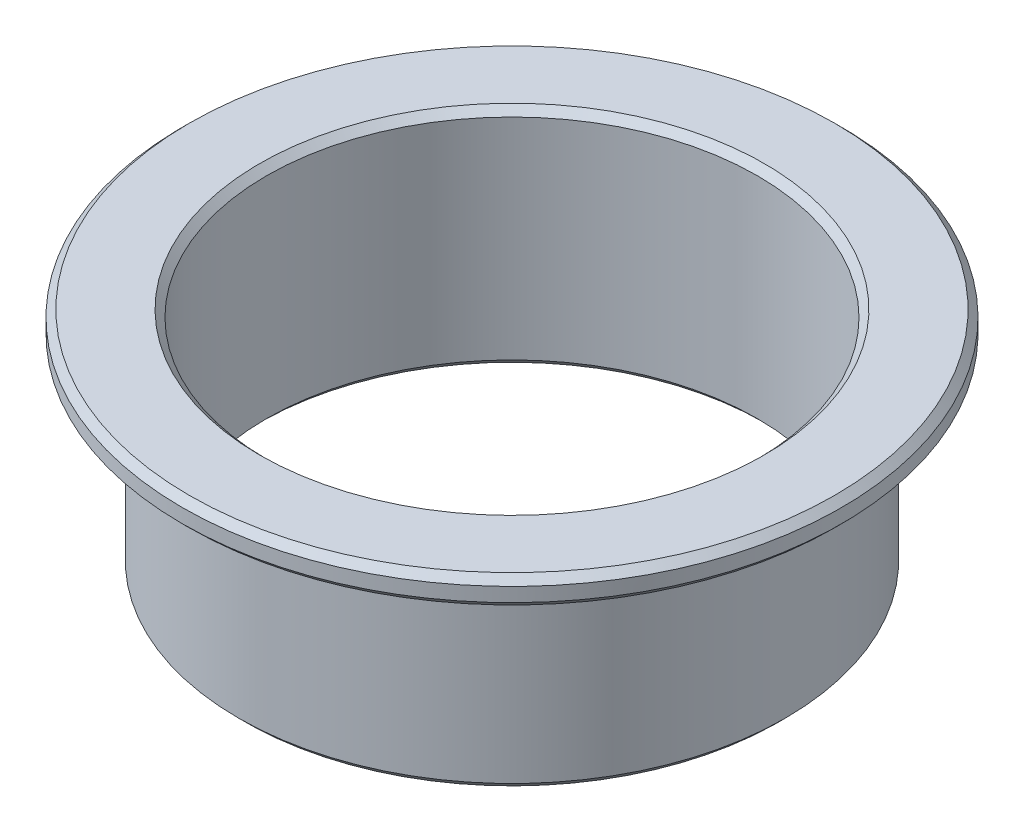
ISO-10303-21;
HEADER;
FILE_DESCRIPTION(('STEP AP214'),'2;1');
FILE_NAME('part.step','',(''),(''),'','','');
FILE_SCHEMA(('AUTOMOTIVE_DESIGN { 1 0 10303 214 1 1 1 1 }'));
ENDSEC;
DATA;
#1=APPLICATION_CONTEXT('core data for automotive mechanical design processes');
#2=APPLICATION_PROTOCOL_DEFINITION('international standard','automotive_design',2000,#1);
#3=PRODUCT_CONTEXT('',#1,'mechanical');
#4=PRODUCT('Part','Part','',(#3));
#5=PRODUCT_RELATED_PRODUCT_CATEGORY('part','',(#4));
#6=PRODUCT_DEFINITION_FORMATION('','',#4);
#7=PRODUCT_DEFINITION_CONTEXT('part definition',#1,'design');
#8=PRODUCT_DEFINITION('design','',#6,#7);
#9=PRODUCT_DEFINITION_SHAPE('','',#8);
#10=(LENGTH_UNIT() NAMED_UNIT(*) SI_UNIT(.MILLI.,.METRE.));
#11=(NAMED_UNIT(*) PLANE_ANGLE_UNIT() SI_UNIT($,.RADIAN.));
#12=(NAMED_UNIT(*) SI_UNIT($,.STERADIAN.) SOLID_ANGLE_UNIT());
#13=UNCERTAINTY_MEASURE_WITH_UNIT(LENGTH_MEASURE(1.E-05),#10,'distance_accuracy_value','');
#14=(GEOMETRIC_REPRESENTATION_CONTEXT(3) GLOBAL_UNCERTAINTY_ASSIGNED_CONTEXT((#13)) GLOBAL_UNIT_ASSIGNED_CONTEXT((#10,
#11,#12)) REPRESENTATION_CONTEXT('',''));
#15=CARTESIAN_POINT('',(0.,0.,0.));
#16=DIRECTION('',(0.,0.,1.));
#17=DIRECTION('',(1.,0.,0.));
#18=AXIS2_PLACEMENT_3D('',#15,#16,#17);
#19=CARTESIAN_POINT('',(0.,32.8284930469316,0.));
#20=DIRECTION('',(0.,1.,0.));
#21=DIRECTION('',(0.,0.,1.));
#22=AXIS2_PLACEMENT_3D('',#19,#20,#21);
#23=CYLINDRICAL_SURFACE('',#22,17.5);
#24=CARTESIAN_POINT('',(0.,-7.25131404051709,0.));
#25=DIRECTION('',(0.,-1.,0.));
#26=DIRECTION('',(0.,0.,-1.));
#27=AXIS2_PLACEMENT_3D('',#24,#25,#26);
#28=CIRCLE('',#27,17.5);
#29=CARTESIAN_POINT('',(0.,-7.25131404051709,-17.5));
#30=VERTEX_POINT('',#29);
#31=EDGE_CURVE('E39',#30,#30,#28,.T.);
#32=ORIENTED_EDGE('',*,*,#31,.T.);
#33=EDGE_LOOP('',(#32));
#34=FACE_BOUND('',#33,.T.);
#35=CARTESIAN_POINT('',(0.,7.7486859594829,0.));
#36=DIRECTION('',(0.,1.,0.));
#37=DIRECTION('',(0.,0.,1.));
#38=AXIS2_PLACEMENT_3D('',#35,#36,#37);
#39=CIRCLE('',#38,17.5);
#40=CARTESIAN_POINT('',(0.,7.7486859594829,17.5));
#41=VERTEX_POINT('',#40);
#42=EDGE_CURVE('E43',#41,#41,#39,.T.);
#43=ORIENTED_EDGE('',*,*,#42,.T.);
#44=EDGE_LOOP('',(#43));
#45=FACE_BOUND('',#44,.T.);
#46=ADVANCED_FACE('F32',(#34,#45),#23,.F.);
#47=CARTESIAN_POINT('',(-17.5,8.24868595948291,0.));
#48=DIRECTION('',(0.,1.,0.));
#49=DIRECTION('',(0.,0.,1.));
#50=AXIS2_PLACEMENT_3D('',#47,#48,#49);
#51=PLANE('',#50);
#52=CARTESIAN_POINT('',(0.,8.24868595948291,0.));
#53=DIRECTION('',(0.,1.,0.));
#54=DIRECTION('',(0.,0.,1.));
#55=AXIS2_PLACEMENT_3D('',#52,#53,#54);
#56=CIRCLE('',#55,23.);
#57=CARTESIAN_POINT('',(0.,8.24868595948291,23.));
#58=VERTEX_POINT('',#57);
#59=EDGE_CURVE('E64',#58,#58,#56,.T.);
#60=ORIENTED_EDGE('',*,*,#59,.T.);
#61=EDGE_LOOP('',(#60));
#62=FACE_BOUND('',#61,.T.);
#63=CARTESIAN_POINT('',(0.,8.24868595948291,0.));
#64=DIRECTION('',(0.,1.,0.));
#65=DIRECTION('',(0.,0.,1.));
#66=AXIS2_PLACEMENT_3D('',#63,#64,#65);
#67=CIRCLE('',#66,18.);
#68=CARTESIAN_POINT('',(0.,8.24868595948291,18.));
#69=VERTEX_POINT('',#68);
#70=EDGE_CURVE('E67',#69,#69,#67,.F.);
#71=ORIENTED_EDGE('',*,*,#70,.T.);
#72=EDGE_LOOP('',(#71));
#73=FACE_BOUND('',#72,.T.);
#74=ADVANCED_FACE('F98',(#62,#73),#51,.T.);
#75=CARTESIAN_POINT('',(0.,32.8284930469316,0.));
#76=DIRECTION('',(0.,1.,0.));
#77=DIRECTION('',(0.,0.,1.));
#78=AXIS2_PLACEMENT_3D('',#75,#76,#77);
#79=CYLINDRICAL_SURFACE('',#78,23.5);
#80=CARTESIAN_POINT('',(0.,7.74868595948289,0.));
#81=DIRECTION('',(0.,1.,0.));
#82=DIRECTION('',(0.,0.,1.));
#83=AXIS2_PLACEMENT_3D('',#80,#81,#82);
#84=CIRCLE('',#83,23.5);
#85=CARTESIAN_POINT('',(0.,7.74868595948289,23.5));
#86=VERTEX_POINT('',#85);
#87=EDGE_CURVE('E58',#86,#86,#84,.F.);
#88=ORIENTED_EDGE('',*,*,#87,.T.);
#89=EDGE_LOOP('',(#88));
#90=FACE_BOUND('',#89,.T.);
#91=CARTESIAN_POINT('',(0.,6.74868595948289,0.));
#92=DIRECTION('',(0.,-1.,0.));
#93=DIRECTION('',(0.,0.,-1.));
#94=AXIS2_PLACEMENT_3D('',#91,#92,#93);
#95=CIRCLE('',#94,23.5);
#96=CARTESIAN_POINT('',(0.,6.74868595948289,-23.5));
#97=VERTEX_POINT('',#96);
#98=EDGE_CURVE('E61',#97,#97,#95,.F.);
#99=ORIENTED_EDGE('',*,*,#98,.T.);
#100=EDGE_LOOP('',(#99));
#101=FACE_BOUND('',#100,.T.);
#102=ADVANCED_FACE('F102',(#90,#101),#79,.T.);
#103=CARTESIAN_POINT('',(-23.5,6.2486859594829,0.));
#104=DIRECTION('',(0.,-1.,0.));
#105=DIRECTION('',(0.,0.,-1.));
#106=AXIS2_PLACEMENT_3D('',#103,#104,#105);
#107=PLANE('',#106);
#108=CARTESIAN_POINT('',(0.,6.2486859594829,0.));
#109=DIRECTION('',(0.,-1.,0.));
#110=DIRECTION('',(0.,0.,-1.));
#111=AXIS2_PLACEMENT_3D('',#108,#109,#110);
#112=CIRCLE('',#111,23.);
#113=CARTESIAN_POINT('',(0.,6.2486859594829,-23.));
#114=VERTEX_POINT('',#113);
#115=EDGE_CURVE('E55',#114,#114,#112,.T.);
#116=ORIENTED_EDGE('',*,*,#115,.T.);
#117=EDGE_LOOP('',(#116));
#118=FACE_BOUND('',#117,.T.);
#119=CARTESIAN_POINT('',(0.,6.2486859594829,0.));
#120=DIRECTION('',(0.,-1.,0.));
#121=DIRECTION('',(0.,0.,-1.));
#122=AXIS2_PLACEMENT_3D('',#119,#120,#121);
#123=CIRCLE('',#122,20.5);
#124=CARTESIAN_POINT('',(0.,6.2486859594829,-20.5));
#125=VERTEX_POINT('',#124);
#126=EDGE_CURVE('E73',#125,#125,#123,.F.);
#127=ORIENTED_EDGE('',*,*,#126,.T.);
#128=EDGE_LOOP('',(#127));
#129=FACE_BOUND('',#128,.T.);
#130=ADVANCED_FACE('F77',(#118,#129),#107,.T.);
#131=CARTESIAN_POINT('',(0.,32.8284930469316,0.));
#132=DIRECTION('',(0.,1.,0.));
#133=DIRECTION('',(0.,0.,1.));
#134=AXIS2_PLACEMENT_3D('',#131,#132,#133);
#135=CYLINDRICAL_SURFACE('',#134,19.5);
#136=CARTESIAN_POINT('',(0.,-7.25131404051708,0.));
#137=DIRECTION('',(0.,-1.,0.));
#138=DIRECTION('',(0.,0.,-1.));
#139=AXIS2_PLACEMENT_3D('',#136,#137,#138);
#140=CIRCLE('',#139,19.5);
#141=CARTESIAN_POINT('',(0.,-7.25131404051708,-19.5));
#142=VERTEX_POINT('',#141);
#143=EDGE_CURVE('E10',#142,#142,#140,.F.);
#144=ORIENTED_EDGE('',*,*,#143,.T.);
#145=EDGE_LOOP('',(#144));
#146=FACE_BOUND('',#145,.T.);
#147=CARTESIAN_POINT('',(0.,5.24868595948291,0.));
#148=DIRECTION('',(0.,-1.,0.));
#149=DIRECTION('',(0.,0.,-1.));
#150=AXIS2_PLACEMENT_3D('',#147,#148,#149);
#151=CIRCLE('',#150,19.5);
#152=CARTESIAN_POINT('',(0.,5.24868595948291,-19.5));
#153=VERTEX_POINT('',#152);
#154=EDGE_CURVE('E70',#153,#153,#151,.T.);
#155=ORIENTED_EDGE('',*,*,#154,.T.);
#156=EDGE_LOOP('',(#155));
#157=FACE_BOUND('',#156,.T.);
#158=ADVANCED_FACE('F92',(#146,#157),#135,.T.);
#159=CARTESIAN_POINT('',(-17.5,-7.75131404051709,0.));
#160=DIRECTION('',(0.,-1.,0.));
#161=DIRECTION('',(0.,0.,-1.));
#162=AXIS2_PLACEMENT_3D('',#159,#160,#161);
#163=PLANE('',#162);
#164=CARTESIAN_POINT('',(0.,-7.75131404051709,0.));
#165=DIRECTION('',(0.,-1.,0.));
#166=DIRECTION('',(0.,0.,-1.));
#167=AXIS2_PLACEMENT_3D('',#164,#165,#166);
#168=CIRCLE('',#167,18.);
#169=CARTESIAN_POINT('',(0.,-7.75131404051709,-18.));
#170=VERTEX_POINT('',#169);
#171=EDGE_CURVE('E47',#170,#170,#168,.F.);
#172=ORIENTED_EDGE('',*,*,#171,.T.);
#173=EDGE_LOOP('',(#172));
#174=FACE_BOUND('',#173,.T.);
#175=CARTESIAN_POINT('',(0.,-7.75131404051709,0.));
#176=DIRECTION('',(0.,-1.,0.));
#177=DIRECTION('',(0.,0.,-1.));
#178=AXIS2_PLACEMENT_3D('',#175,#176,#177);
#179=CIRCLE('',#178,19.);
#180=CARTESIAN_POINT('',(0.,-7.75131404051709,-19.));
#181=VERTEX_POINT('',#180);
#182=EDGE_CURVE('E52',#181,#181,#179,.T.);
#183=ORIENTED_EDGE('',*,*,#182,.T.);
#184=EDGE_LOOP('',(#183));
#185=FACE_BOUND('',#184,.T.);
#186=ADVANCED_FACE('F82',(#174,#185),#163,.T.);
#187=CARTESIAN_POINT('',(0.,5.24868595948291,0.));
#188=DIRECTION('',(0.,-1.,0.));
#189=DIRECTION('',(0.,0.,-1.));
#190=AXIS2_PLACEMENT_3D('',#187,#188,#189);
#191=TOROIDAL_SURFACE('',#190,20.5,1.);
#192=ORIENTED_EDGE('',*,*,#154,.F.);
#193=EDGE_LOOP('',(#192));
#194=FACE_BOUND('',#193,.T.);
#195=ORIENTED_EDGE('',*,*,#126,.F.);
#196=EDGE_LOOP('',(#195));
#197=FACE_BOUND('',#196,.T.);
#198=ADVANCED_FACE('F79',(#194,#197),#191,.F.);
#199=CARTESIAN_POINT('',(0.,8.24868595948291,0.));
#200=DIRECTION('',(0.,-1.,0.));
#201=DIRECTION('',(0.,0.,-1.));
#202=AXIS2_PLACEMENT_3D('',#199,#200,#201);
#203=CONICAL_SURFACE('',#202,23.,0.785398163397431);
#204=ORIENTED_EDGE('',*,*,#87,.F.);
#205=EDGE_LOOP('',(#204));
#206=FACE_BOUND('',#205,.T.);
#207=ORIENTED_EDGE('',*,*,#59,.F.);
#208=EDGE_LOOP('',(#207));
#209=FACE_BOUND('',#208,.T.);
#210=ADVANCED_FACE('F81',(#206,#209),#203,.T.);
#211=CARTESIAN_POINT('',(0.,6.74868595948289,0.));
#212=DIRECTION('',(0.,1.,0.));
#213=DIRECTION('',(0.,0.,1.));
#214=AXIS2_PLACEMENT_3D('',#211,#212,#213);
#215=CONICAL_SURFACE('',#214,23.5,0.785398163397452);
#216=ORIENTED_EDGE('',*,*,#115,.F.);
#217=EDGE_LOOP('',(#216));
#218=FACE_BOUND('',#217,.T.);
#219=ORIENTED_EDGE('',*,*,#98,.F.);
#220=EDGE_LOOP('',(#219));
#221=FACE_BOUND('',#220,.T.);
#222=ADVANCED_FACE('F89',(#218,#221),#215,.T.);
#223=CARTESIAN_POINT('',(0.,-7.75131404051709,0.));
#224=DIRECTION('',(0.,-1.,0.));
#225=DIRECTION('',(0.,0.,-1.));
#226=AXIS2_PLACEMENT_3D('',#223,#224,#225);
#227=CONICAL_SURFACE('',#226,18.,0.785398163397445);
#228=ORIENTED_EDGE('',*,*,#31,.F.);
#229=EDGE_LOOP('',(#228));
#230=FACE_BOUND('',#229,.T.);
#231=ORIENTED_EDGE('',*,*,#171,.F.);
#232=EDGE_LOOP('',(#231));
#233=FACE_BOUND('',#232,.T.);
#234=ADVANCED_FACE('F139',(#230,#233),#227,.F.);
#235=CARTESIAN_POINT('',(0.,-7.25131404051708,0.));
#236=DIRECTION('',(0.,1.,0.));
#237=DIRECTION('',(0.,0.,1.));
#238=AXIS2_PLACEMENT_3D('',#235,#236,#237);
#239=CONICAL_SURFACE('',#238,19.5,0.785398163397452);
#240=ORIENTED_EDGE('',*,*,#182,.F.);
#241=EDGE_LOOP('',(#240));
#242=FACE_BOUND('',#241,.T.);
#243=ORIENTED_EDGE('',*,*,#143,.F.);
#244=EDGE_LOOP('',(#243));
#245=FACE_BOUND('',#244,.T.);
#246=ADVANCED_FACE('F149',(#242,#245),#239,.T.);
#247=CARTESIAN_POINT('',(0.,7.7486859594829,0.));
#248=DIRECTION('',(0.,1.,0.));
#249=DIRECTION('',(0.,0.,1.));
#250=AXIS2_PLACEMENT_3D('',#247,#248,#249);
#251=CONICAL_SURFACE('',#250,17.5,0.785398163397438);
#252=ORIENTED_EDGE('',*,*,#70,.F.);
#253=EDGE_LOOP('',(#252));
#254=FACE_BOUND('',#253,.T.);
#255=ORIENTED_EDGE('',*,*,#42,.F.);
#256=EDGE_LOOP('',(#255));
#257=FACE_BOUND('',#256,.T.);
#258=ADVANCED_FACE('F34',(#254,#257),#251,.F.);
#259=CLOSED_SHELL('',(#46,#74,#102,#130,#158,#186,#198,#210,#222,#234,#246,#258));
#260=MANIFOLD_SOLID_BREP('B2',#259);
#261=ADVANCED_BREP_SHAPE_REPRESENTATION('',(#18,#260),#14);
#262=SHAPE_DEFINITION_REPRESENTATION(#9,#261);
ENDSEC;
END-ISO-10303-21;
